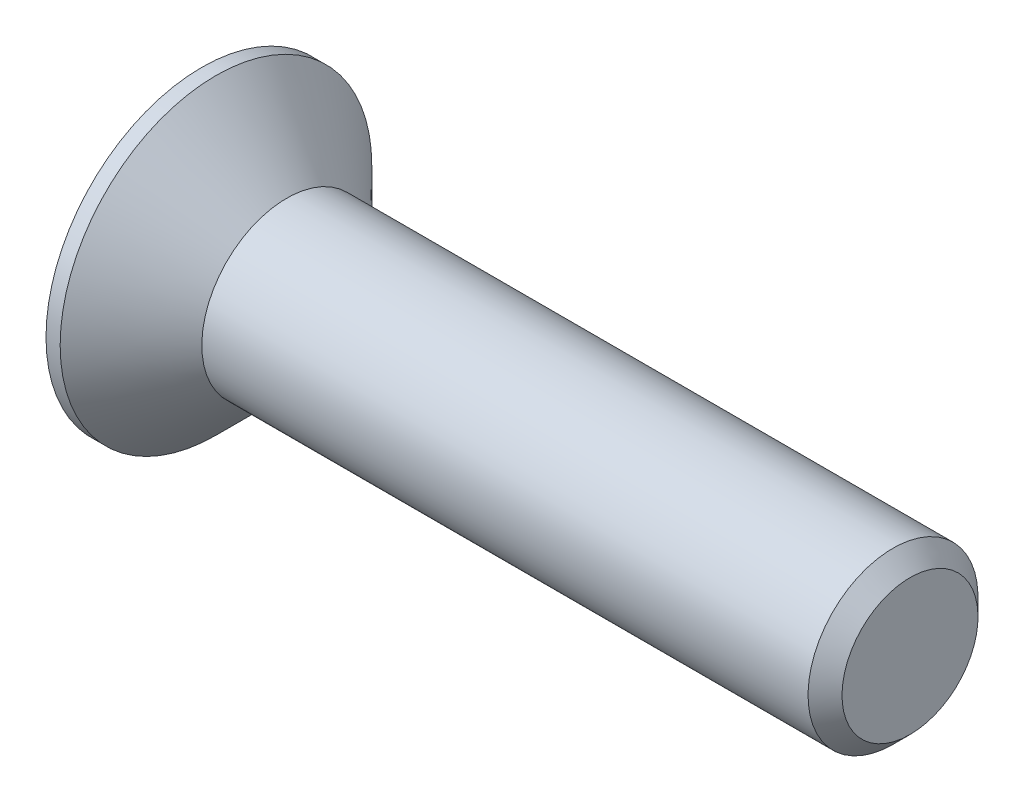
ISO-10303-21;
HEADER;
FILE_DESCRIPTION(('STEP AP214'),'2;1');
FILE_NAME('part.step','',(''),(''),'','','');
FILE_SCHEMA(('AUTOMOTIVE_DESIGN { 1 0 10303 214 1 1 1 1 }'));
ENDSEC;
DATA;
#1=APPLICATION_CONTEXT('core data for automotive mechanical design processes');
#2=APPLICATION_PROTOCOL_DEFINITION('international standard','automotive_design',2000,#1);
#3=PRODUCT_CONTEXT('',#1,'mechanical');
#4=PRODUCT('Part','Part','',(#3));
#5=PRODUCT_RELATED_PRODUCT_CATEGORY('part','',(#4));
#6=PRODUCT_DEFINITION_FORMATION('','',#4);
#7=PRODUCT_DEFINITION_CONTEXT('part definition',#1,'design');
#8=PRODUCT_DEFINITION('design','',#6,#7);
#9=PRODUCT_DEFINITION_SHAPE('','',#8);
#10=(LENGTH_UNIT() NAMED_UNIT(*) SI_UNIT(.MILLI.,.METRE.));
#11=(NAMED_UNIT(*) PLANE_ANGLE_UNIT() SI_UNIT($,.RADIAN.));
#12=(NAMED_UNIT(*) SI_UNIT($,.STERADIAN.) SOLID_ANGLE_UNIT());
#13=UNCERTAINTY_MEASURE_WITH_UNIT(LENGTH_MEASURE(1.E-05),#10,'distance_accuracy_value','');
#14=(GEOMETRIC_REPRESENTATION_CONTEXT(3) GLOBAL_UNCERTAINTY_ASSIGNED_CONTEXT((#13)) GLOBAL_UNIT_ASSIGNED_CONTEXT((#10,
#11,#12)) REPRESENTATION_CONTEXT('',''));
#15=CARTESIAN_POINT('',(0.,0.,0.));
#16=DIRECTION('',(0.,0.,1.));
#17=DIRECTION('',(1.,0.,0.));
#18=AXIS2_PLACEMENT_3D('',#15,#16,#17);
#19=CARTESIAN_POINT('',(0.,0.,0.));
#20=DIRECTION('',(-1.,0.,0.));
#21=DIRECTION('',(0.,-1.,0.));
#22=AXIS2_PLACEMENT_3D('',#19,#20,#21);
#23=CONICAL_SURFACE('',#22,3.,0.78539816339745);
#24=CARTESIAN_POINT('',(-2.49999999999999,0.,0.));
#25=DIRECTION('',(-1.,0.,0.));
#26=DIRECTION('',(0.,-1.,0.));
#27=AXIS2_PLACEMENT_3D('',#24,#25,#26);
#28=CIRCLE('',#27,5.5);
#29=CARTESIAN_POINT('',(-2.49999999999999,-5.5,0.));
#30=VERTEX_POINT('',#29);
#31=EDGE_CURVE('E189',#30,#30,#28,.T.);
#32=ORIENTED_EDGE('',*,*,#31,.F.);
#33=EDGE_LOOP('',(#32));
#34=FACE_BOUND('',#33,.T.);
#35=CARTESIAN_POINT('',(0.,0.,0.));
#36=DIRECTION('',(-1.,0.,0.));
#37=DIRECTION('',(0.,-1.,0.));
#38=AXIS2_PLACEMENT_3D('',#35,#36,#37);
#39=CIRCLE('',#38,3.);
#40=CARTESIAN_POINT('',(0.,-3.,0.));
#41=VERTEX_POINT('',#40);
#42=EDGE_CURVE('E212',#41,#41,#39,.T.);
#43=ORIENTED_EDGE('',*,*,#42,.T.);
#44=EDGE_LOOP('',(#43));
#45=FACE_BOUND('',#44,.T.);
#46=ADVANCED_FACE('F33',(#34,#45),#23,.T.);
#47=CARTESIAN_POINT('',(-3.,0.,0.));
#48=DIRECTION('',(-1.,0.,0.));
#49=DIRECTION('',(0.,-1.,0.));
#50=AXIS2_PLACEMENT_3D('',#47,#48,#49);
#51=CYLINDRICAL_SURFACE('',#50,3.);
#52=CARTESIAN_POINT('',(21.4,0.,0.));
#53=DIRECTION('',(-1.,0.,0.));
#54=DIRECTION('',(0.,-1.,0.));
#55=AXIS2_PLACEMENT_3D('',#52,#53,#54);
#56=CIRCLE('',#55,3.);
#57=CARTESIAN_POINT('',(21.4,-3.,0.));
#58=VERTEX_POINT('',#57);
#59=EDGE_CURVE('E41',#58,#58,#56,.T.);
#60=ORIENTED_EDGE('',*,*,#59,.T.);
#61=EDGE_LOOP('',(#60));
#62=FACE_BOUND('',#61,.T.);
#63=ORIENTED_EDGE('',*,*,#42,.F.);
#64=EDGE_LOOP('',(#63));
#65=FACE_BOUND('',#64,.T.);
#66=ADVANCED_FACE('F217',(#62,#65),#51,.T.);
#67=CARTESIAN_POINT('',(22.,0.,0.));
#68=DIRECTION('',(-1.,0.,0.));
#69=DIRECTION('',(0.,-1.,0.));
#70=AXIS2_PLACEMENT_3D('',#67,#68,#69);
#71=PLANE('',#70);
#72=CARTESIAN_POINT('',(22.,0.,0.));
#73=DIRECTION('',(-1.,0.,0.));
#74=DIRECTION('',(0.,-1.,0.));
#75=AXIS2_PLACEMENT_3D('',#72,#73,#74);
#76=CIRCLE('',#75,2.39999999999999);
#77=CARTESIAN_POINT('',(22.,-2.39999999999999,0.));
#78=VERTEX_POINT('',#77);
#79=EDGE_CURVE('E11',#78,#78,#76,.F.);
#80=ORIENTED_EDGE('',*,*,#79,.T.);
#81=EDGE_LOOP('',(#80));
#82=FACE_BOUND('',#81,.T.);
#83=ADVANCED_FACE('F239',(#82),#71,.F.);
#84=CARTESIAN_POINT('',(-3.,5.5,0.));
#85=DIRECTION('',(1.,0.,0.));
#86=DIRECTION('',(0.,1.,0.));
#87=AXIS2_PLACEMENT_3D('',#84,#85,#86);
#88=PLANE('',#87);
#89=DIRECTION('',(0.,0.,-1.));
#90=VECTOR('',#89,1.);
#91=CARTESIAN_POINT('',(-3.,0.825,-3.3));
#92=LINE('',#91,#90);
#93=CARTESIAN_POINT('',(-3.,0.825,-0.825));
#94=VERTEX_POINT('',#93);
#95=CARTESIAN_POINT('',(-3.,0.825,-3.3));
#96=VERTEX_POINT('',#95);
#97=EDGE_CURVE('E158',#94,#96,#92,.T.);
#98=ORIENTED_EDGE('',*,*,#97,.F.);
#99=DIRECTION('',(0.,-1.,0.));
#100=VECTOR('',#99,1.);
#101=CARTESIAN_POINT('',(-3.,0.825,-0.825));
#102=LINE('',#101,#100);
#103=CARTESIAN_POINT('',(-3.,3.3,-0.825));
#104=VERTEX_POINT('',#103);
#105=EDGE_CURVE('E48',#104,#94,#102,.T.);
#106=ORIENTED_EDGE('',*,*,#105,.F.);
#107=DIRECTION('',(0.,0.,-1.));
#108=VECTOR('',#107,1.);
#109=CARTESIAN_POINT('',(-3.,3.3,-0.825));
#110=LINE('',#109,#108);
#111=CARTESIAN_POINT('',(-3.,3.3,0.825));
#112=VERTEX_POINT('',#111);
#113=EDGE_CURVE('E185',#112,#104,#110,.T.);
#114=ORIENTED_EDGE('',*,*,#113,.F.);
#115=DIRECTION('',(0.,1.,0.));
#116=VECTOR('',#115,1.);
#117=CARTESIAN_POINT('',(-3.,3.3,0.825));
#118=LINE('',#117,#116);
#119=CARTESIAN_POINT('',(-3.,0.825,0.825));
#120=VERTEX_POINT('',#119);
#121=EDGE_CURVE('E183',#120,#112,#118,.T.);
#122=ORIENTED_EDGE('',*,*,#121,.F.);
#123=DIRECTION('',(0.,0.,-1.));
#124=VECTOR('',#123,1.);
#125=CARTESIAN_POINT('',(-3.,0.825,0.825));
#126=LINE('',#125,#124);
#127=CARTESIAN_POINT('',(-3.,0.825,3.3));
#128=VERTEX_POINT('',#127);
#129=EDGE_CURVE('E132',#128,#120,#126,.T.);
#130=ORIENTED_EDGE('',*,*,#129,.F.);
#131=DIRECTION('',(0.,1.,0.));
#132=VECTOR('',#131,1.);
#133=CARTESIAN_POINT('',(-3.,0.825,3.3));
#134=LINE('',#133,#132);
#135=CARTESIAN_POINT('',(-3.,-0.825,3.3));
#136=VERTEX_POINT('',#135);
#137=EDGE_CURVE('E179',#136,#128,#134,.T.);
#138=ORIENTED_EDGE('',*,*,#137,.F.);
#139=DIRECTION('',(0.,0.,1.));
#140=VECTOR('',#139,1.);
#141=CARTESIAN_POINT('',(-3.,-0.825,3.3));
#142=LINE('',#141,#140);
#143=CARTESIAN_POINT('',(-3.,-0.825,0.825));
#144=VERTEX_POINT('',#143);
#145=EDGE_CURVE('E176',#144,#136,#142,.T.);
#146=ORIENTED_EDGE('',*,*,#145,.F.);
#147=DIRECTION('',(0.,1.,0.));
#148=VECTOR('',#147,1.);
#149=CARTESIAN_POINT('',(-3.,-0.825,0.825));
#150=LINE('',#149,#148);
#151=CARTESIAN_POINT('',(-3.,-3.3,0.825));
#152=VERTEX_POINT('',#151);
#153=EDGE_CURVE('E173',#152,#144,#150,.T.);
#154=ORIENTED_EDGE('',*,*,#153,.F.);
#155=DIRECTION('',(0.,0.,1.));
#156=VECTOR('',#155,1.);
#157=CARTESIAN_POINT('',(-3.,-3.3,0.825));
#158=LINE('',#157,#156);
#159=CARTESIAN_POINT('',(-3.,-3.3,-0.825));
#160=VERTEX_POINT('',#159);
#161=EDGE_CURVE('E170',#160,#152,#158,.T.);
#162=ORIENTED_EDGE('',*,*,#161,.F.);
#163=DIRECTION('',(0.,-1.,0.));
#164=VECTOR('',#163,1.);
#165=CARTESIAN_POINT('',(-3.,-3.3,-0.825));
#166=LINE('',#165,#164);
#167=CARTESIAN_POINT('',(-3.,-0.825,-0.825));
#168=VERTEX_POINT('',#167);
#169=EDGE_CURVE('E167',#168,#160,#166,.T.);
#170=ORIENTED_EDGE('',*,*,#169,.F.);
#171=DIRECTION('',(0.,0.,1.));
#172=VECTOR('',#171,1.);
#173=CARTESIAN_POINT('',(-3.,-0.825,-0.825));
#174=LINE('',#173,#172);
#175=CARTESIAN_POINT('',(-3.,-0.825,-3.3));
#176=VERTEX_POINT('',#175);
#177=EDGE_CURVE('E164',#176,#168,#174,.T.);
#178=ORIENTED_EDGE('',*,*,#177,.F.);
#179=DIRECTION('',(0.,-1.,0.));
#180=VECTOR('',#179,1.);
#181=CARTESIAN_POINT('',(-3.,-0.825,-3.3));
#182=LINE('',#181,#180);
#183=EDGE_CURVE('E161',#96,#176,#182,.T.);
#184=ORIENTED_EDGE('',*,*,#183,.F.);
#185=EDGE_LOOP('',(#98,#106,#114,#122,#130,#138,#146,#154,#162,#170,#178,#184));
#186=FACE_BOUND('',#185,.T.);
#187=CARTESIAN_POINT('',(-3.,0.,0.));
#188=DIRECTION('',(-1.,0.,0.));
#189=DIRECTION('',(0.,-1.,0.));
#190=AXIS2_PLACEMENT_3D('',#187,#188,#189);
#191=CIRCLE('',#190,5.5);
#192=CARTESIAN_POINT('',(-3.,-5.5,0.));
#193=VERTEX_POINT('',#192);
#194=EDGE_CURVE('E209',#193,#193,#191,.T.);
#195=ORIENTED_EDGE('',*,*,#194,.T.);
#196=EDGE_LOOP('',(#195));
#197=FACE_BOUND('',#196,.T.);
#198=ADVANCED_FACE('F230',(#186,#197),#88,.F.);
#199=CARTESIAN_POINT('',(-3.,0.,0.));
#200=DIRECTION('',(-1.,0.,0.));
#201=DIRECTION('',(0.,-1.,0.));
#202=AXIS2_PLACEMENT_3D('',#199,#200,#201);
#203=CYLINDRICAL_SURFACE('',#202,5.5);
#204=ORIENTED_EDGE('',*,*,#194,.F.);
#205=EDGE_LOOP('',(#204));
#206=FACE_BOUND('',#205,.T.);
#207=ORIENTED_EDGE('',*,*,#31,.T.);
#208=EDGE_LOOP('',(#207));
#209=FACE_BOUND('',#208,.T.);
#210=ADVANCED_FACE('F222',(#206,#209),#203,.T.);
#211=CARTESIAN_POINT('',(21.4,0.,0.));
#212=DIRECTION('',(-1.,0.,0.));
#213=DIRECTION('',(0.,-1.,0.));
#214=AXIS2_PLACEMENT_3D('',#211,#212,#213);
#215=CONICAL_SURFACE('',#214,3.,0.785398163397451);
#216=ORIENTED_EDGE('',*,*,#79,.F.);
#217=EDGE_LOOP('',(#216));
#218=FACE_BOUND('',#217,.T.);
#219=ORIENTED_EDGE('',*,*,#59,.F.);
#220=EDGE_LOOP('',(#219));
#221=FACE_BOUND('',#220,.T.);
#222=ADVANCED_FACE('F35',(#218,#221),#215,.T.);
#223=CARTESIAN_POINT('',(-0.5,0.825,-0.825));
#224=DIRECTION('',(0.,0.,-1.));
#225=DIRECTION('',(-1.,0.,0.));
#226=AXIS2_PLACEMENT_3D('',#223,#224,#225);
#227=PLANE('',#226);
#228=ORIENTED_EDGE('',*,*,#105,.T.);
#229=DIRECTION('',(-1.,0.,0.));
#230=VECTOR('',#229,1.);
#231=CARTESIAN_POINT('',(-0.5,0.825,-0.825));
#232=LINE('',#231,#230);
#233=CARTESIAN_POINT('',(-0.5,0.825,-0.825));
#234=VERTEX_POINT('',#233);
#235=EDGE_CURVE('E96',#234,#94,#232,.T.);
#236=ORIENTED_EDGE('',*,*,#235,.F.);
#237=DIRECTION('',(0.,-1.,0.));
#238=VECTOR('',#237,1.);
#239=CARTESIAN_POINT('',(-0.5,0.825,-0.825));
#240=LINE('',#239,#238);
#241=CARTESIAN_POINT('',(-0.5,3.3,-0.825));
#242=VERTEX_POINT('',#241);
#243=EDGE_CURVE('E187',#242,#234,#240,.T.);
#244=ORIENTED_EDGE('',*,*,#243,.F.);
#245=DIRECTION('',(-1.,0.,0.));
#246=VECTOR('',#245,1.);
#247=CARTESIAN_POINT('',(-0.5,3.3,-0.825));
#248=LINE('',#247,#246);
#249=EDGE_CURVE('E56',#242,#104,#248,.T.);
#250=ORIENTED_EDGE('',*,*,#249,.T.);
#251=EDGE_LOOP('',(#228,#236,#244,#250));
#252=FACE_BOUND('',#251,.T.);
#253=ADVANCED_FACE('F221',(#252),#227,.F.);
#254=CARTESIAN_POINT('',(-0.5,3.3,-0.825));
#255=DIRECTION('',(0.,1.,0.));
#256=DIRECTION('',(-1.,0.,0.));
#257=AXIS2_PLACEMENT_3D('',#254,#255,#256);
#258=PLANE('',#257);
#259=ORIENTED_EDGE('',*,*,#113,.T.);
#260=ORIENTED_EDGE('',*,*,#249,.F.);
#261=DIRECTION('',(0.,0.,-1.));
#262=VECTOR('',#261,1.);
#263=CARTESIAN_POINT('',(-0.5,3.3,-0.825));
#264=LINE('',#263,#262);
#265=CARTESIAN_POINT('',(-0.5,3.3,0.825));
#266=VERTEX_POINT('',#265);
#267=EDGE_CURVE('E144',#266,#242,#264,.T.);
#268=ORIENTED_EDGE('',*,*,#267,.F.);
#269=DIRECTION('',(-1.,0.,0.));
#270=VECTOR('',#269,1.);
#271=CARTESIAN_POINT('',(-0.5,3.3,0.825));
#272=LINE('',#271,#270);
#273=EDGE_CURVE('E136',#266,#112,#272,.T.);
#274=ORIENTED_EDGE('',*,*,#273,.T.);
#275=EDGE_LOOP('',(#259,#260,#268,#274));
#276=FACE_BOUND('',#275,.T.);
#277=ADVANCED_FACE('F228',(#276),#258,.F.);
#278=CARTESIAN_POINT('',(-0.5,3.3,0.825));
#279=DIRECTION('',(0.,0.,1.));
#280=DIRECTION('',(1.,0.,0.));
#281=AXIS2_PLACEMENT_3D('',#278,#279,#280);
#282=PLANE('',#281);
#283=ORIENTED_EDGE('',*,*,#121,.T.);
#284=ORIENTED_EDGE('',*,*,#273,.F.);
#285=DIRECTION('',(0.,1.,0.));
#286=VECTOR('',#285,1.);
#287=CARTESIAN_POINT('',(-0.5,3.3,0.825));
#288=LINE('',#287,#286);
#289=CARTESIAN_POINT('',(-0.5,0.825,0.825));
#290=VERTEX_POINT('',#289);
#291=EDGE_CURVE('E140',#290,#266,#288,.T.);
#292=ORIENTED_EDGE('',*,*,#291,.F.);
#293=DIRECTION('',(-1.,0.,0.));
#294=VECTOR('',#293,1.);
#295=CARTESIAN_POINT('',(-0.5,0.825,0.825));
#296=LINE('',#295,#294);
#297=EDGE_CURVE('E125',#290,#120,#296,.T.);
#298=ORIENTED_EDGE('',*,*,#297,.T.);
#299=EDGE_LOOP('',(#283,#284,#292,#298));
#300=FACE_BOUND('',#299,.T.);
#301=ADVANCED_FACE('F141',(#300),#282,.F.);
#302=CARTESIAN_POINT('',(-0.5,0.825,0.825));
#303=DIRECTION('',(0.,1.,0.));
#304=DIRECTION('',(-1.,0.,0.));
#305=AXIS2_PLACEMENT_3D('',#302,#303,#304);
#306=PLANE('',#305);
#307=ORIENTED_EDGE('',*,*,#129,.T.);
#308=ORIENTED_EDGE('',*,*,#297,.F.);
#309=DIRECTION('',(0.,0.,-1.));
#310=VECTOR('',#309,1.);
#311=CARTESIAN_POINT('',(-0.5,0.825,0.825));
#312=LINE('',#311,#310);
#313=CARTESIAN_POINT('',(-0.5,0.825,3.3));
#314=VERTEX_POINT('',#313);
#315=EDGE_CURVE('E129',#314,#290,#312,.T.);
#316=ORIENTED_EDGE('',*,*,#315,.F.);
#317=DIRECTION('',(-1.,0.,0.));
#318=VECTOR('',#317,1.);
#319=CARTESIAN_POINT('',(-0.5,0.825,3.3));
#320=LINE('',#319,#318);
#321=EDGE_CURVE('E137',#314,#128,#320,.T.);
#322=ORIENTED_EDGE('',*,*,#321,.T.);
#323=EDGE_LOOP('',(#307,#308,#316,#322));
#324=FACE_BOUND('',#323,.T.);
#325=ADVANCED_FACE('F127',(#324),#306,.F.);
#326=CARTESIAN_POINT('',(-0.5,0.825,3.3));
#327=DIRECTION('',(0.,0.,1.));
#328=DIRECTION('',(1.,0.,0.));
#329=AXIS2_PLACEMENT_3D('',#326,#327,#328);
#330=PLANE('',#329);
#331=ORIENTED_EDGE('',*,*,#137,.T.);
#332=ORIENTED_EDGE('',*,*,#321,.F.);
#333=DIRECTION('',(0.,1.,0.));
#334=VECTOR('',#333,1.);
#335=CARTESIAN_POINT('',(-0.5,0.825,3.3));
#336=LINE('',#335,#334);
#337=CARTESIAN_POINT('',(-0.5,-0.825,3.3));
#338=VERTEX_POINT('',#337);
#339=EDGE_CURVE('E150',#338,#314,#336,.T.);
#340=ORIENTED_EDGE('',*,*,#339,.F.);
#341=DIRECTION('',(-1.,0.,0.));
#342=VECTOR('',#341,1.);
#343=CARTESIAN_POINT('',(-0.5,-0.825,3.3));
#344=LINE('',#343,#342);
#345=EDGE_CURVE('E192',#338,#136,#344,.T.);
#346=ORIENTED_EDGE('',*,*,#345,.T.);
#347=EDGE_LOOP('',(#331,#332,#340,#346));
#348=FACE_BOUND('',#347,.T.);
#349=ADVANCED_FACE('F277',(#348),#330,.F.);
#350=CARTESIAN_POINT('',(-0.5,-0.825,3.3));
#351=DIRECTION('',(0.,-1.,0.));
#352=DIRECTION('',(1.,0.,0.));
#353=AXIS2_PLACEMENT_3D('',#350,#351,#352);
#354=PLANE('',#353);
#355=ORIENTED_EDGE('',*,*,#145,.T.);
#356=ORIENTED_EDGE('',*,*,#345,.F.);
#357=DIRECTION('',(0.,0.,1.));
#358=VECTOR('',#357,1.);
#359=CARTESIAN_POINT('',(-0.5,-0.825,3.3));
#360=LINE('',#359,#358);
#361=CARTESIAN_POINT('',(-0.5,-0.825,0.825));
#362=VERTEX_POINT('',#361);
#363=EDGE_CURVE('E152',#362,#338,#360,.T.);
#364=ORIENTED_EDGE('',*,*,#363,.F.);
#365=DIRECTION('',(-1.,0.,0.));
#366=VECTOR('',#365,1.);
#367=CARTESIAN_POINT('',(-0.5,-0.825,0.825));
#368=LINE('',#367,#366);
#369=EDGE_CURVE('E194',#362,#144,#368,.T.);
#370=ORIENTED_EDGE('',*,*,#369,.T.);
#371=EDGE_LOOP('',(#355,#356,#364,#370));
#372=FACE_BOUND('',#371,.T.);
#373=ADVANCED_FACE('F273',(#372),#354,.F.);
#374=CARTESIAN_POINT('',(-0.5,-0.825,0.825));
#375=DIRECTION('',(0.,0.,1.));
#376=DIRECTION('',(1.,0.,0.));
#377=AXIS2_PLACEMENT_3D('',#374,#375,#376);
#378=PLANE('',#377);
#379=ORIENTED_EDGE('',*,*,#153,.T.);
#380=ORIENTED_EDGE('',*,*,#369,.F.);
#381=DIRECTION('',(0.,1.,0.));
#382=VECTOR('',#381,1.);
#383=CARTESIAN_POINT('',(-0.5,-0.825,0.825));
#384=LINE('',#383,#382);
#385=CARTESIAN_POINT('',(-0.5,-3.3,0.825));
#386=VERTEX_POINT('',#385);
#387=EDGE_CURVE('E422',#386,#362,#384,.T.);
#388=ORIENTED_EDGE('',*,*,#387,.F.);
#389=DIRECTION('',(-1.,0.,0.));
#390=VECTOR('',#389,1.);
#391=CARTESIAN_POINT('',(-0.5,-3.3,0.825));
#392=LINE('',#391,#390);
#393=EDGE_CURVE('E196',#386,#152,#392,.T.);
#394=ORIENTED_EDGE('',*,*,#393,.T.);
#395=EDGE_LOOP('',(#379,#380,#388,#394));
#396=FACE_BOUND('',#395,.T.);
#397=ADVANCED_FACE('F269',(#396),#378,.F.);
#398=CARTESIAN_POINT('',(-0.5,-3.3,0.825));
#399=DIRECTION('',(0.,-1.,0.));
#400=DIRECTION('',(1.,0.,0.));
#401=AXIS2_PLACEMENT_3D('',#398,#399,#400);
#402=PLANE('',#401);
#403=ORIENTED_EDGE('',*,*,#161,.T.);
#404=ORIENTED_EDGE('',*,*,#393,.F.);
#405=DIRECTION('',(0.,0.,1.));
#406=VECTOR('',#405,1.);
#407=CARTESIAN_POINT('',(-0.5,-3.3,0.825));
#408=LINE('',#407,#406);
#409=CARTESIAN_POINT('',(-0.5,-3.3,-0.825));
#410=VERTEX_POINT('',#409);
#411=EDGE_CURVE('E419',#410,#386,#408,.T.);
#412=ORIENTED_EDGE('',*,*,#411,.F.);
#413=DIRECTION('',(-1.,0.,0.));
#414=VECTOR('',#413,1.);
#415=CARTESIAN_POINT('',(-0.5,-3.3,-0.825));
#416=LINE('',#415,#414);
#417=EDGE_CURVE('E198',#410,#160,#416,.T.);
#418=ORIENTED_EDGE('',*,*,#417,.T.);
#419=EDGE_LOOP('',(#403,#404,#412,#418));
#420=FACE_BOUND('',#419,.T.);
#421=ADVANCED_FACE('F265',(#420),#402,.F.);
#422=CARTESIAN_POINT('',(-0.5,-3.3,-0.825));
#423=DIRECTION('',(0.,0.,-1.));
#424=DIRECTION('',(-1.,0.,0.));
#425=AXIS2_PLACEMENT_3D('',#422,#423,#424);
#426=PLANE('',#425);
#427=ORIENTED_EDGE('',*,*,#169,.T.);
#428=ORIENTED_EDGE('',*,*,#417,.F.);
#429=DIRECTION('',(0.,-1.,0.));
#430=VECTOR('',#429,1.);
#431=CARTESIAN_POINT('',(-0.5,-3.3,-0.825));
#432=LINE('',#431,#430);
#433=CARTESIAN_POINT('',(-0.5,-0.825,-0.825));
#434=VERTEX_POINT('',#433);
#435=EDGE_CURVE('E416',#434,#410,#432,.T.);
#436=ORIENTED_EDGE('',*,*,#435,.F.);
#437=DIRECTION('',(-1.,0.,0.));
#438=VECTOR('',#437,1.);
#439=CARTESIAN_POINT('',(-0.5,-0.825,-0.825));
#440=LINE('',#439,#438);
#441=EDGE_CURVE('E200',#434,#168,#440,.T.);
#442=ORIENTED_EDGE('',*,*,#441,.T.);
#443=EDGE_LOOP('',(#427,#428,#436,#442));
#444=FACE_BOUND('',#443,.T.);
#445=ADVANCED_FACE('F261',(#444),#426,.F.);
#446=CARTESIAN_POINT('',(-0.5,-0.825,-0.825));
#447=DIRECTION('',(0.,-1.,0.));
#448=DIRECTION('',(1.,0.,0.));
#449=AXIS2_PLACEMENT_3D('',#446,#447,#448);
#450=PLANE('',#449);
#451=ORIENTED_EDGE('',*,*,#177,.T.);
#452=ORIENTED_EDGE('',*,*,#441,.F.);
#453=DIRECTION('',(0.,0.,1.));
#454=VECTOR('',#453,1.);
#455=CARTESIAN_POINT('',(-0.5,-0.825,-0.825));
#456=LINE('',#455,#454);
#457=CARTESIAN_POINT('',(-0.5,-0.825,-3.3));
#458=VERTEX_POINT('',#457);
#459=EDGE_CURVE('E413',#458,#434,#456,.T.);
#460=ORIENTED_EDGE('',*,*,#459,.F.);
#461=DIRECTION('',(-1.,0.,0.));
#462=VECTOR('',#461,1.);
#463=CARTESIAN_POINT('',(-0.5,-0.825,-3.3));
#464=LINE('',#463,#462);
#465=EDGE_CURVE('E202',#458,#176,#464,.T.);
#466=ORIENTED_EDGE('',*,*,#465,.T.);
#467=EDGE_LOOP('',(#451,#452,#460,#466));
#468=FACE_BOUND('',#467,.T.);
#469=ADVANCED_FACE('F257',(#468),#450,.F.);
#470=CARTESIAN_POINT('',(-0.5,-0.825,-3.3));
#471=DIRECTION('',(0.,0.,-1.));
#472=DIRECTION('',(-1.,0.,0.));
#473=AXIS2_PLACEMENT_3D('',#470,#471,#472);
#474=PLANE('',#473);
#475=ORIENTED_EDGE('',*,*,#183,.T.);
#476=ORIENTED_EDGE('',*,*,#465,.F.);
#477=DIRECTION('',(0.,-1.,0.));
#478=VECTOR('',#477,1.);
#479=CARTESIAN_POINT('',(-0.5,-0.825,-3.3));
#480=LINE('',#479,#478);
#481=CARTESIAN_POINT('',(-0.5,0.825,-3.3));
#482=VERTEX_POINT('',#481);
#483=EDGE_CURVE('E408',#482,#458,#480,.T.);
#484=ORIENTED_EDGE('',*,*,#483,.F.);
#485=DIRECTION('',(-1.,0.,0.));
#486=VECTOR('',#485,1.);
#487=CARTESIAN_POINT('',(-0.5,0.825,-3.3));
#488=LINE('',#487,#486);
#489=EDGE_CURVE('E204',#482,#96,#488,.T.);
#490=ORIENTED_EDGE('',*,*,#489,.T.);
#491=EDGE_LOOP('',(#475,#476,#484,#490));
#492=FACE_BOUND('',#491,.T.);
#493=ADVANCED_FACE('F253',(#492),#474,.F.);
#494=CARTESIAN_POINT('',(-0.5,0.825,-3.3));
#495=DIRECTION('',(0.,1.,0.));
#496=DIRECTION('',(-1.,0.,0.));
#497=AXIS2_PLACEMENT_3D('',#494,#495,#496);
#498=PLANE('',#497);
#499=ORIENTED_EDGE('',*,*,#97,.T.);
#500=ORIENTED_EDGE('',*,*,#489,.F.);
#501=DIRECTION('',(0.,0.,-1.));
#502=VECTOR('',#501,1.);
#503=CARTESIAN_POINT('',(-0.5,0.825,-3.3));
#504=LINE('',#503,#502);
#505=EDGE_CURVE('E406',#234,#482,#504,.T.);
#506=ORIENTED_EDGE('',*,*,#505,.F.);
#507=ORIENTED_EDGE('',*,*,#235,.T.);
#508=EDGE_LOOP('',(#499,#500,#506,#507));
#509=FACE_BOUND('',#508,.T.);
#510=ADVANCED_FACE('F250',(#509),#498,.F.);
#511=CARTESIAN_POINT('',(-0.5,0.,0.));
#512=DIRECTION('',(1.,0.,0.));
#513=DIRECTION('',(0.,0.,-1.));
#514=AXIS2_PLACEMENT_3D('',#511,#512,#513);
#515=PLANE('',#514);
#516=ORIENTED_EDGE('',*,*,#243,.T.);
#517=ORIENTED_EDGE('',*,*,#505,.T.);
#518=ORIENTED_EDGE('',*,*,#483,.T.);
#519=ORIENTED_EDGE('',*,*,#459,.T.);
#520=ORIENTED_EDGE('',*,*,#435,.T.);
#521=ORIENTED_EDGE('',*,*,#411,.T.);
#522=ORIENTED_EDGE('',*,*,#387,.T.);
#523=ORIENTED_EDGE('',*,*,#363,.T.);
#524=ORIENTED_EDGE('',*,*,#339,.T.);
#525=ORIENTED_EDGE('',*,*,#315,.T.);
#526=ORIENTED_EDGE('',*,*,#291,.T.);
#527=ORIENTED_EDGE('',*,*,#267,.T.);
#528=EDGE_LOOP('',(#516,#517,#518,#519,#520,#521,#522,#523,#524,#525,#526,#527));
#529=FACE_BOUND('',#528,.T.);
#530=ADVANCED_FACE('F147',(#529),#515,.F.);
#531=CLOSED_SHELL('',(#46,#66,#83,#198,#210,#222,#253,#277,#301,#325,#349,#373,#397,#421,#445,
#469,#493,#510,#530));
#532=MANIFOLD_SOLID_BREP('B2',#531);
#533=ADVANCED_BREP_SHAPE_REPRESENTATION('',(#18,#532),#14);
#534=SHAPE_DEFINITION_REPRESENTATION(#9,#533);
ENDSEC;
END-ISO-10303-21;
